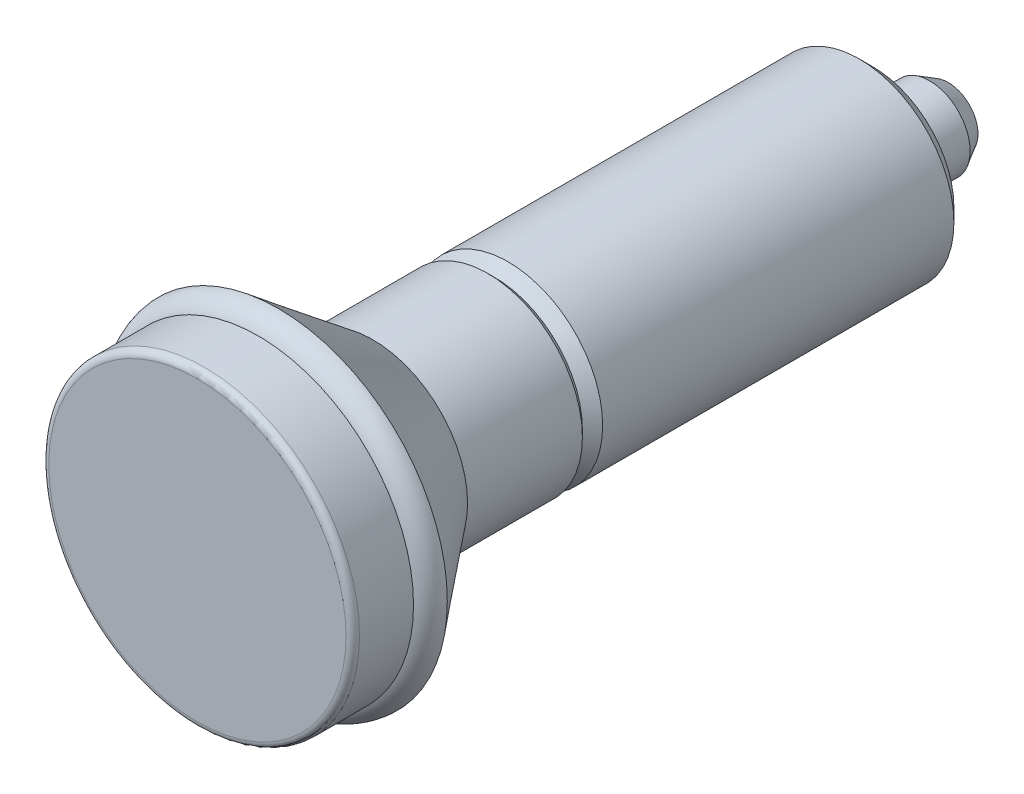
ISO-10303-21;
HEADER;
FILE_DESCRIPTION(('STEP AP214'),'2;1');
FILE_NAME('part.step','',(''),(''),'','','');
FILE_SCHEMA(('AUTOMOTIVE_DESIGN { 1 0 10303 214 1 1 1 1 }'));
ENDSEC;
DATA;
#1=APPLICATION_CONTEXT('core data for automotive mechanical design processes');
#2=APPLICATION_PROTOCOL_DEFINITION('international standard','automotive_design',2000,#1);
#3=PRODUCT_CONTEXT('',#1,'mechanical');
#4=PRODUCT('Part','Part','',(#3));
#5=PRODUCT_RELATED_PRODUCT_CATEGORY('part','',(#4));
#6=PRODUCT_DEFINITION_FORMATION('','',#4);
#7=PRODUCT_DEFINITION_CONTEXT('part definition',#1,'design');
#8=PRODUCT_DEFINITION('design','',#6,#7);
#9=PRODUCT_DEFINITION_SHAPE('','',#8);
#10=(LENGTH_UNIT() NAMED_UNIT(*) SI_UNIT(.MILLI.,.METRE.));
#11=(NAMED_UNIT(*) PLANE_ANGLE_UNIT() SI_UNIT($,.RADIAN.));
#12=(NAMED_UNIT(*) SI_UNIT($,.STERADIAN.) SOLID_ANGLE_UNIT());
#13=UNCERTAINTY_MEASURE_WITH_UNIT(LENGTH_MEASURE(1.E-05),#10,'distance_accuracy_value','');
#14=(GEOMETRIC_REPRESENTATION_CONTEXT(3) GLOBAL_UNCERTAINTY_ASSIGNED_CONTEXT((#13)) GLOBAL_UNIT_ASSIGNED_CONTEXT((#10,
#11,#12)) REPRESENTATION_CONTEXT('',''));
#15=CARTESIAN_POINT('',(0.,0.,0.));
#16=DIRECTION('',(0.,0.,1.));
#17=DIRECTION('',(1.,0.,0.));
#18=AXIS2_PLACEMENT_3D('',#15,#16,#17);
#19=CARTESIAN_POINT('',(0.,0.,0.));
#20=DIRECTION('',(0.,0.,1.));
#21=DIRECTION('',(0.,1.,0.));
#22=AXIS2_PLACEMENT_3D('',#19,#20,#21);
#23=SPHERICAL_SURFACE('',#22,6.00000000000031);
#24=CARTESIAN_POINT('',(0.,0.,-5.58107460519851));
#25=DIRECTION('',(0.,0.,1.));
#26=DIRECTION('',(1.,0.,0.));
#27=AXIS2_PLACEMENT_3D('',#24,#25,#26);
#28=CIRCLE('',#27,2.2026362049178);
#29=CARTESIAN_POINT('',(2.2026362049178,0.,-5.58107460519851));
#30=VERTEX_POINT('',#29);
#31=EDGE_CURVE('E58',#30,#30,#28,.T.);
#32=ORIENTED_EDGE('',*,*,#31,.F.);
#33=EDGE_LOOP('',(#32));
#34=FACE_BOUND('',#33,.T.);
#35=ADVANCED_FACE('F12',(#34),#23,.T.);
#36=CARTESIAN_POINT('',(0.,0.,50.));
#37=DIRECTION('',(0.,0.,1.));
#38=DIRECTION('',(1.,0.,0.));
#39=AXIS2_PLACEMENT_3D('',#36,#37,#38);
#40=PLANE('',#39);
#41=CARTESIAN_POINT('',(0.,0.,50.));
#42=DIRECTION('',(0.,0.,1.));
#43=DIRECTION('',(1.,0.,0.));
#44=AXIS2_PLACEMENT_3D('',#41,#42,#43);
#45=CIRCLE('',#44,10.9999999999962);
#46=CARTESIAN_POINT('',(10.9999999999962,0.,50.));
#47=VERTEX_POINT('',#46);
#48=EDGE_CURVE('E8',#47,#47,#45,.T.);
#49=ORIENTED_EDGE('',*,*,#48,.T.);
#50=EDGE_LOOP('',(#49));
#51=FACE_BOUND('',#50,.T.);
#52=ADVANCED_FACE('F66',(#51),#40,.T.);
#53=CARTESIAN_POINT('',(0.,0.,49.5));
#54=DIRECTION('',(0.,0.,1.));
#55=DIRECTION('',(1.,0.,0.));
#56=AXIS2_PLACEMENT_3D('',#53,#54,#55);
#57=TOROIDAL_SURFACE('',#56,10.9999999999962,0.5);
#58=CARTESIAN_POINT('',(0.,0.,49.5));
#59=DIRECTION('',(0.,0.,1.));
#60=DIRECTION('',(1.,0.,0.));
#61=AXIS2_PLACEMENT_3D('',#58,#59,#60);
#62=CIRCLE('',#61,11.4999999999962);
#63=CARTESIAN_POINT('',(11.4999999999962,0.,49.5));
#64=VERTEX_POINT('',#63);
#65=EDGE_CURVE('E18',#64,#64,#62,.T.);
#66=ORIENTED_EDGE('',*,*,#65,.T.);
#67=EDGE_LOOP('',(#66));
#68=FACE_BOUND('',#67,.T.);
#69=ORIENTED_EDGE('',*,*,#48,.F.);
#70=EDGE_LOOP('',(#69));
#71=FACE_BOUND('',#70,.T.);
#72=ADVANCED_FACE('F71',(#68,#71),#57,.T.);
#73=CARTESIAN_POINT('',(0.,0.,50.));
#74=DIRECTION('',(0.,0.,1.));
#75=DIRECTION('',(1.,0.,0.));
#76=AXIS2_PLACEMENT_3D('',#73,#74,#75);
#77=CYLINDRICAL_SURFACE('',#76,11.4999999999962);
#78=CARTESIAN_POINT('',(0.,0.,45.5000000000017));
#79=DIRECTION('',(0.,0.,1.));
#80=DIRECTION('',(1.,0.,0.));
#81=AXIS2_PLACEMENT_3D('',#78,#79,#80);
#82=CIRCLE('',#81,11.4999999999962);
#83=CARTESIAN_POINT('',(11.4999999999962,0.,45.5000000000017));
#84=VERTEX_POINT('',#83);
#85=EDGE_CURVE('E22',#84,#84,#82,.T.);
#86=ORIENTED_EDGE('',*,*,#85,.T.);
#87=EDGE_LOOP('',(#86));
#88=FACE_BOUND('',#87,.T.);
#89=ORIENTED_EDGE('',*,*,#65,.F.);
#90=EDGE_LOOP('',(#89));
#91=FACE_BOUND('',#90,.T.);
#92=ADVANCED_FACE('F75',(#88,#91),#77,.T.);
#93=CARTESIAN_POINT('',(0.,0.,44.));
#94=DIRECTION('',(0.,0.,1.));
#95=DIRECTION('',(1.,0.,0.));
#96=AXIS2_PLACEMENT_3D('',#93,#94,#95);
#97=TOROIDAL_SURFACE('',#96,10.8749999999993,1.62500000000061);
#98=CARTESIAN_POINT('',(0.,0.,43.9999999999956));
#99=DIRECTION('',(0.,0.,1.));
#100=DIRECTION('',(1.,0.,0.));
#101=AXIS2_PLACEMENT_3D('',#98,#99,#100);
#102=CIRCLE('',#101,12.5);
#103=CARTESIAN_POINT('',(12.5,0.,43.9999999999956));
#104=VERTEX_POINT('',#103);
#105=EDGE_CURVE('E26',#104,#104,#102,.T.);
#106=ORIENTED_EDGE('',*,*,#105,.T.);
#107=EDGE_LOOP('',(#106));
#108=FACE_BOUND('',#107,.T.);
#109=ORIENTED_EDGE('',*,*,#85,.F.);
#110=EDGE_LOOP('',(#109));
#111=FACE_BOUND('',#110,.T.);
#112=ADVANCED_FACE('F80',(#108,#111),#97,.T.);
#113=CARTESIAN_POINT('',(0.,0.,43.9999999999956));
#114=DIRECTION('',(0.,0.,1.));
#115=DIRECTION('',(1.,0.,0.));
#116=AXIS2_PLACEMENT_3D('',#113,#114,#115);
#117=CONICAL_SURFACE('',#116,12.5,0.665969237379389);
#118=CARTESIAN_POINT('',(0.,0.,37.));
#119=DIRECTION('',(0.,0.,1.));
#120=DIRECTION('',(1.,0.,0.));
#121=AXIS2_PLACEMENT_3D('',#118,#119,#120);
#122=CIRCLE('',#121,7.);
#123=CARTESIAN_POINT('',(7.,0.,37.));
#124=VERTEX_POINT('',#123);
#125=EDGE_CURVE('E31',#124,#124,#122,.T.);
#126=ORIENTED_EDGE('',*,*,#125,.T.);
#127=EDGE_LOOP('',(#126));
#128=FACE_BOUND('',#127,.T.);
#129=ORIENTED_EDGE('',*,*,#105,.F.);
#130=EDGE_LOOP('',(#129));
#131=FACE_BOUND('',#130,.T.);
#132=ADVANCED_FACE('F84',(#128,#131),#117,.T.);
#133=CARTESIAN_POINT('',(0.,0.,50.));
#134=DIRECTION('',(0.,0.,1.));
#135=DIRECTION('',(1.,0.,0.));
#136=AXIS2_PLACEMENT_3D('',#133,#134,#135);
#137=CYLINDRICAL_SURFACE('',#136,7.);
#138=CARTESIAN_POINT('',(0.,0.,28.4999999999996));
#139=DIRECTION('',(0.,0.,1.));
#140=DIRECTION('',(1.,0.,0.));
#141=AXIS2_PLACEMENT_3D('',#138,#139,#140);
#142=CIRCLE('',#141,7.);
#143=CARTESIAN_POINT('',(7.,0.,28.4999999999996));
#144=VERTEX_POINT('',#143);
#145=EDGE_CURVE('E34',#144,#144,#142,.T.);
#146=ORIENTED_EDGE('',*,*,#145,.T.);
#147=EDGE_LOOP('',(#146));
#148=FACE_BOUND('',#147,.T.);
#149=ORIENTED_EDGE('',*,*,#125,.F.);
#150=EDGE_LOOP('',(#149));
#151=FACE_BOUND('',#150,.T.);
#152=ADVANCED_FACE('F88',(#148,#151),#137,.T.);
#153=CARTESIAN_POINT('',(0.,0.,28.4999999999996));
#154=DIRECTION('',(0.,0.,1.));
#155=DIRECTION('',(1.,0.,0.));
#156=AXIS2_PLACEMENT_3D('',#153,#154,#155);
#157=CONICAL_SURFACE('',#156,7.,0.785398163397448);
#158=CARTESIAN_POINT('',(0.,0.,27.9999999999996));
#159=DIRECTION('',(0.,0.,1.));
#160=DIRECTION('',(1.,0.,0.));
#161=AXIS2_PLACEMENT_3D('',#158,#159,#160);
#162=CIRCLE('',#161,6.5);
#163=CARTESIAN_POINT('',(6.5,0.,27.9999999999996));
#164=VERTEX_POINT('',#163);
#165=EDGE_CURVE('E37',#164,#164,#162,.T.);
#166=ORIENTED_EDGE('',*,*,#165,.T.);
#167=EDGE_LOOP('',(#166));
#168=FACE_BOUND('',#167,.T.);
#169=ORIENTED_EDGE('',*,*,#145,.F.);
#170=EDGE_LOOP('',(#169));
#171=FACE_BOUND('',#170,.T.);
#172=ADVANCED_FACE('F92',(#168,#171),#157,.T.);
#173=CARTESIAN_POINT('',(0.,6.,27.9999999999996));
#174=DIRECTION('',(0.,0.,-1.));
#175=DIRECTION('',(-1.,0.,0.));
#176=AXIS2_PLACEMENT_3D('',#173,#174,#175);
#177=PLANE('',#176);
#178=CARTESIAN_POINT('',(0.,0.,27.9999999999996));
#179=DIRECTION('',(0.,0.,1.));
#180=DIRECTION('',(1.,0.,0.));
#181=AXIS2_PLACEMENT_3D('',#178,#179,#180);
#182=CIRCLE('',#181,6.);
#183=CARTESIAN_POINT('',(6.,0.,27.9999999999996));
#184=VERTEX_POINT('',#183);
#185=EDGE_CURVE('E40',#184,#184,#182,.T.);
#186=ORIENTED_EDGE('',*,*,#185,.T.);
#187=EDGE_LOOP('',(#186));
#188=FACE_BOUND('',#187,.T.);
#189=ORIENTED_EDGE('',*,*,#165,.F.);
#190=EDGE_LOOP('',(#189));
#191=FACE_BOUND('',#190,.T.);
#192=ADVANCED_FACE('F96',(#188,#191),#177,.T.);
#193=CARTESIAN_POINT('',(0.,0.,27.9999999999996));
#194=DIRECTION('',(0.,0.,-1.));
#195=DIRECTION('',(-1.,0.,0.));
#196=AXIS2_PLACEMENT_3D('',#193,#194,#195);
#197=CONICAL_SURFACE('',#196,6.,0.785398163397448);
#198=CARTESIAN_POINT('',(0.,0.,26.9999999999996));
#199=DIRECTION('',(0.,0.,1.));
#200=DIRECTION('',(1.,0.,0.));
#201=AXIS2_PLACEMENT_3D('',#198,#199,#200);
#202=CIRCLE('',#201,7.);
#203=CARTESIAN_POINT('',(7.,0.,26.9999999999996));
#204=VERTEX_POINT('',#203);
#205=EDGE_CURVE('E43',#204,#204,#202,.T.);
#206=ORIENTED_EDGE('',*,*,#205,.T.);
#207=EDGE_LOOP('',(#206));
#208=FACE_BOUND('',#207,.T.);
#209=ORIENTED_EDGE('',*,*,#185,.F.);
#210=EDGE_LOOP('',(#209));
#211=FACE_BOUND('',#210,.T.);
#212=ADVANCED_FACE('F100',(#208,#211),#197,.T.);
#213=CARTESIAN_POINT('',(0.,0.,50.));
#214=DIRECTION('',(0.,0.,1.));
#215=DIRECTION('',(1.,0.,0.));
#216=AXIS2_PLACEMENT_3D('',#213,#214,#215);
#217=CYLINDRICAL_SURFACE('',#216,7.);
#218=CARTESIAN_POINT('',(0.,0.,1.));
#219=DIRECTION('',(0.,0.,1.));
#220=DIRECTION('',(1.,0.,0.));
#221=AXIS2_PLACEMENT_3D('',#218,#219,#220);
#222=CIRCLE('',#221,7.);
#223=CARTESIAN_POINT('',(7.,0.,1.));
#224=VERTEX_POINT('',#223);
#225=EDGE_CURVE('E46',#224,#224,#222,.T.);
#226=ORIENTED_EDGE('',*,*,#225,.T.);
#227=EDGE_LOOP('',(#226));
#228=FACE_BOUND('',#227,.T.);
#229=ORIENTED_EDGE('',*,*,#205,.F.);
#230=EDGE_LOOP('',(#229));
#231=FACE_BOUND('',#230,.T.);
#232=ADVANCED_FACE('F104',(#228,#231),#217,.T.);
#233=CARTESIAN_POINT('',(0.,0.,1.));
#234=DIRECTION('',(0.,0.,1.));
#235=DIRECTION('',(1.,0.,0.));
#236=AXIS2_PLACEMENT_3D('',#233,#234,#235);
#237=CONICAL_SURFACE('',#236,7.,0.785398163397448);
#238=CARTESIAN_POINT('',(0.,0.,0.));
#239=DIRECTION('',(0.,0.,1.));
#240=DIRECTION('',(1.,0.,0.));
#241=AXIS2_PLACEMENT_3D('',#238,#239,#240);
#242=CIRCLE('',#241,6.);
#243=CARTESIAN_POINT('',(6.,0.,0.));
#244=VERTEX_POINT('',#243);
#245=EDGE_CURVE('E49',#244,#244,#242,.T.);
#246=ORIENTED_EDGE('',*,*,#245,.T.);
#247=EDGE_LOOP('',(#246));
#248=FACE_BOUND('',#247,.T.);
#249=ORIENTED_EDGE('',*,*,#225,.F.);
#250=EDGE_LOOP('',(#249));
#251=FACE_BOUND('',#250,.T.);
#252=ADVANCED_FACE('F108',(#248,#251),#237,.T.);
#253=CARTESIAN_POINT('',(0.,3.,0.));
#254=DIRECTION('',(0.,0.,-1.));
#255=DIRECTION('',(-1.,0.,0.));
#256=AXIS2_PLACEMENT_3D('',#253,#254,#255);
#257=PLANE('',#256);
#258=CARTESIAN_POINT('',(0.,0.,0.));
#259=DIRECTION('',(0.,0.,1.));
#260=DIRECTION('',(1.,0.,0.));
#261=AXIS2_PLACEMENT_3D('',#258,#259,#260);
#262=CIRCLE('',#261,3.);
#263=CARTESIAN_POINT('',(3.,0.,0.));
#264=VERTEX_POINT('',#263);
#265=EDGE_CURVE('E52',#264,#264,#262,.T.);
#266=ORIENTED_EDGE('',*,*,#265,.T.);
#267=EDGE_LOOP('',(#266));
#268=FACE_BOUND('',#267,.T.);
#269=ORIENTED_EDGE('',*,*,#245,.F.);
#270=EDGE_LOOP('',(#269));
#271=FACE_BOUND('',#270,.T.);
#272=ADVANCED_FACE('F112',(#268,#271),#257,.T.);
#273=CARTESIAN_POINT('',(0.,0.,50.));
#274=DIRECTION('',(0.,0.,1.));
#275=DIRECTION('',(1.,0.,0.));
#276=AXIS2_PLACEMENT_3D('',#273,#274,#275);
#277=CYLINDRICAL_SURFACE('',#276,3.);
#278=CARTESIAN_POINT('',(0.,0.,-4.2));
#279=DIRECTION('',(0.,0.,1.));
#280=DIRECTION('',(1.,0.,0.));
#281=AXIS2_PLACEMENT_3D('',#278,#279,#280);
#282=CIRCLE('',#281,3.);
#283=CARTESIAN_POINT('',(3.,0.,-4.2));
#284=VERTEX_POINT('',#283);
#285=EDGE_CURVE('E55',#284,#284,#282,.T.);
#286=ORIENTED_EDGE('',*,*,#285,.T.);
#287=EDGE_LOOP('',(#286));
#288=FACE_BOUND('',#287,.T.);
#289=ORIENTED_EDGE('',*,*,#265,.F.);
#290=EDGE_LOOP('',(#289));
#291=FACE_BOUND('',#290,.T.);
#292=ADVANCED_FACE('F116',(#288,#291),#277,.T.);
#293=CARTESIAN_POINT('',(0.,0.,-4.2));
#294=DIRECTION('',(0.,0.,1.));
#295=DIRECTION('',(1.,0.,0.));
#296=AXIS2_PLACEMENT_3D('',#293,#294,#295);
#297=CONICAL_SURFACE('',#296,3.,0.523598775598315);
#298=ORIENTED_EDGE('',*,*,#31,.T.);
#299=EDGE_LOOP('',(#298));
#300=FACE_BOUND('',#299,.T.);
#301=ORIENTED_EDGE('',*,*,#285,.F.);
#302=EDGE_LOOP('',(#301));
#303=FACE_BOUND('',#302,.T.);
#304=ADVANCED_FACE('F62',(#300,#303),#297,.T.);
#305=CLOSED_SHELL('',(#35,#52,#72,#92,#112,#132,#152,#172,#192,#212,#232,#252,#272,#292,#304));
#306=MANIFOLD_SOLID_BREP('B1',#305);
#307=ADVANCED_BREP_SHAPE_REPRESENTATION('',(#18,#306),#14);
#308=SHAPE_DEFINITION_REPRESENTATION(#9,#307);
ENDSEC;
END-ISO-10303-21;
